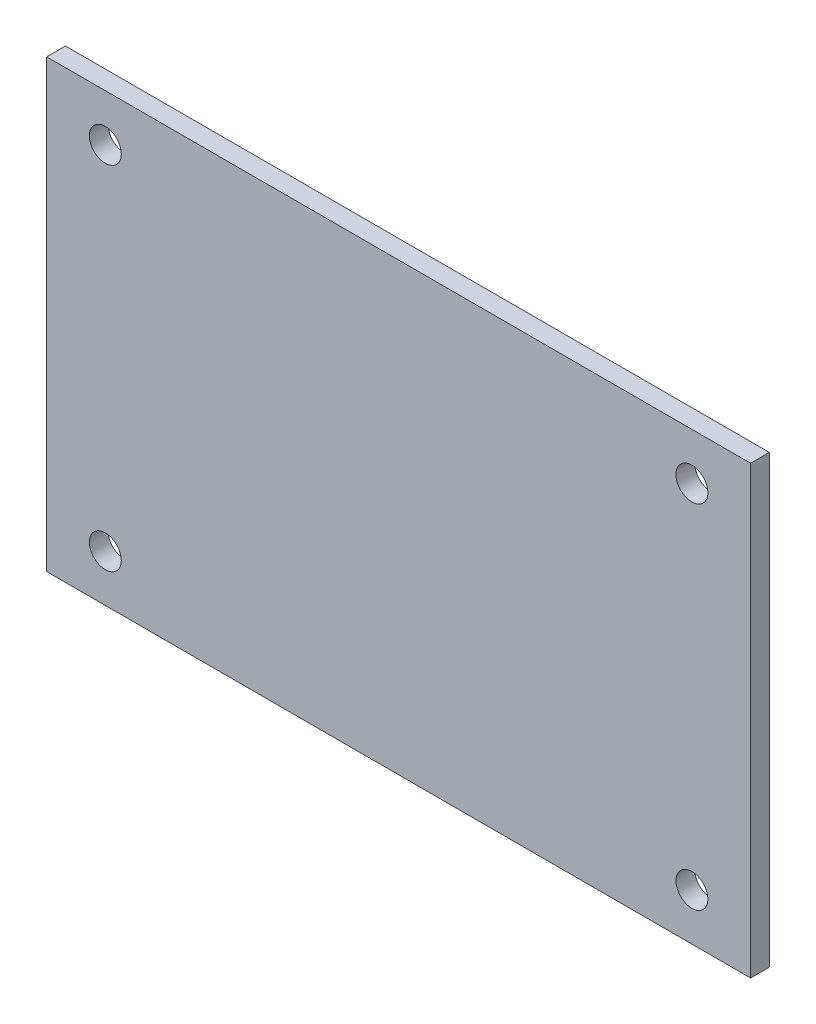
from build123d import *

# Parameters (mm, degrees)
ESQUISSE2_W      = 150
ESQUISSE2_H      = 95
ESQUISSE2_R      = 3.4
EXTRUSION1_DEPTH = 4


with BuildPart() as part:
    # Esquisse2 → Extrusion1 (new body)
    with BuildSketch(Plane.XY):
        with Locations((0, 47.5)):
            Rectangle(ESQUISSE2_W, ESQUISSE2_H)
        with Locations((-62.5, 10)):
            Circle(ESQUISSE2_R, mode=Mode.SUBTRACT)
        with Locations((-62.5, 85)):
            Circle(ESQUISSE2_R, mode=Mode.SUBTRACT)
        with Locations((62.5, 10)):
            Circle(ESQUISSE2_R, mode=Mode.SUBTRACT)
        with Locations((62.5, 85)):
            Circle(ESQUISSE2_R, mode=Mode.SUBTRACT)
    extrude(amount=-EXTRUSION1_DEPTH)


solid = part.part
